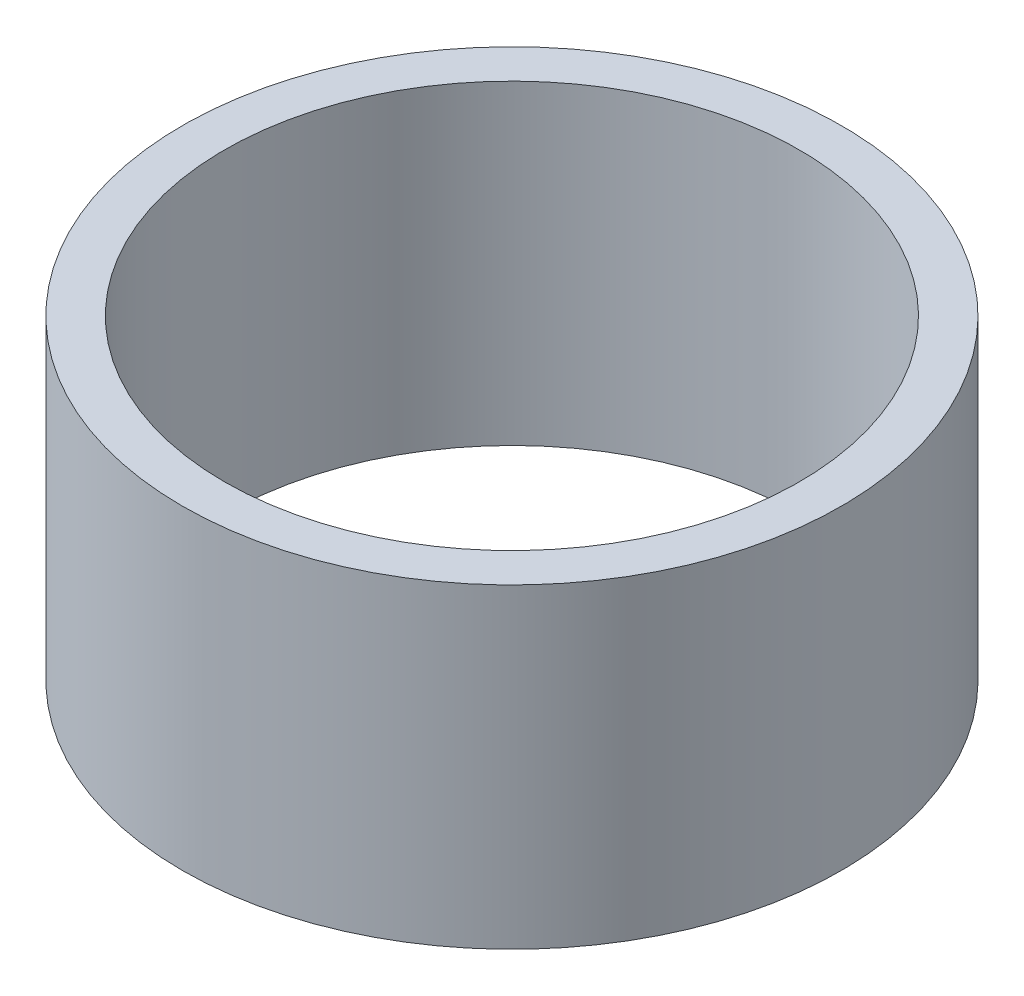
from build123d import *

# Parameters (mm, degrees)
ESQUISSE1_W = 3
ESQUISSE1_H = 22.5


with BuildPart() as part:
    # Esquisse1 → R_volution1 (revolve)
    with BuildSketch(Plane.XY, mode=Mode.PRIVATE) as r_volution1_sk:
        with Locations((22, 14.644276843)):
            Rectangle(ESQUISSE1_W, ESQUISSE1_H)
    revolve(r_volution1_sk.sketch.rotate(Axis((0, 28.120065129, 0), (0, -1, 0)), 90), axis=Axis((0, 28.120065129, 0), (0, -1, 0)))


solid = part.part
